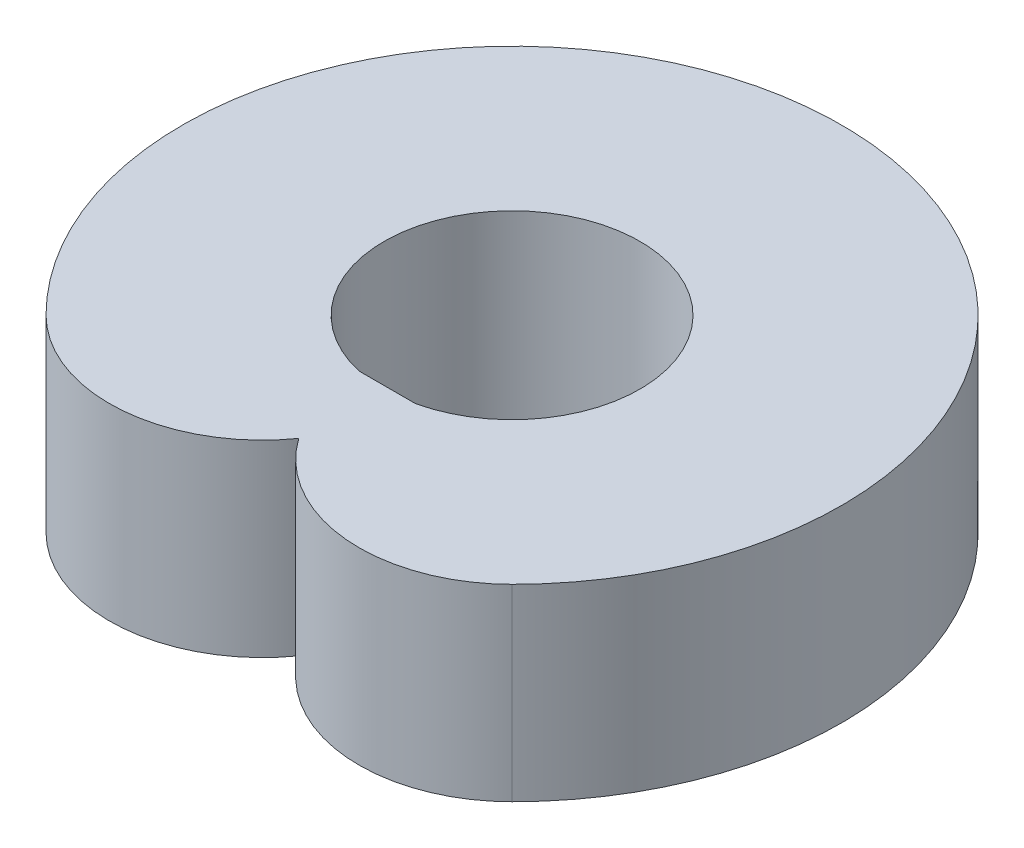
ISO-10303-21;
HEADER;
FILE_DESCRIPTION(('STEP AP214'),'2;1');
FILE_NAME('part.step','',(''),(''),'','','');
FILE_SCHEMA(('AUTOMOTIVE_DESIGN { 1 0 10303 214 1 1 1 1 }'));
ENDSEC;
DATA;
#1=APPLICATION_CONTEXT('core data for automotive mechanical design processes');
#2=APPLICATION_PROTOCOL_DEFINITION('international standard','automotive_design',2000,#1);
#3=PRODUCT_CONTEXT('',#1,'mechanical');
#4=PRODUCT('Part','Part','',(#3));
#5=PRODUCT_RELATED_PRODUCT_CATEGORY('part','',(#4));
#6=PRODUCT_DEFINITION_FORMATION('','',#4);
#7=PRODUCT_DEFINITION_CONTEXT('part definition',#1,'design');
#8=PRODUCT_DEFINITION('design','',#6,#7);
#9=PRODUCT_DEFINITION_SHAPE('','',#8);
#10=(LENGTH_UNIT() NAMED_UNIT(*) SI_UNIT(.MILLI.,.METRE.));
#11=(NAMED_UNIT(*) PLANE_ANGLE_UNIT() SI_UNIT($,.RADIAN.));
#12=(NAMED_UNIT(*) SI_UNIT($,.STERADIAN.) SOLID_ANGLE_UNIT());
#13=UNCERTAINTY_MEASURE_WITH_UNIT(LENGTH_MEASURE(1.E-05),#10,'distance_accuracy_value','');
#14=(GEOMETRIC_REPRESENTATION_CONTEXT(3) GLOBAL_UNCERTAINTY_ASSIGNED_CONTEXT((#13)) GLOBAL_UNIT_ASSIGNED_CONTEXT((#10,
#11,#12)) REPRESENTATION_CONTEXT('',''));
#15=CARTESIAN_POINT('',(0.,0.,0.));
#16=DIRECTION('',(0.,0.,1.));
#17=DIRECTION('',(1.,0.,0.));
#18=AXIS2_PLACEMENT_3D('',#15,#16,#17);
#19=CARTESIAN_POINT('',(132.582521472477,400.,132.582521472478));
#20=DIRECTION('',(0.,1.,0.));
#21=DIRECTION('',(0.,0.,1.));
#22=AXIS2_PLACEMENT_3D('',#19,#20,#21);
#23=PLANE('',#22);
#24=CARTESIAN_POINT('',(265.165042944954,400.,265.165042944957));
#25=DIRECTION('',(0.,1.,0.));
#26=DIRECTION('',(0.,0.,1.));
#27=AXIS2_PLACEMENT_3D('',#24,#25,#26);
#28=CIRCLE('',#27,325.);
#29=CARTESIAN_POINT('',(1.11022302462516E-13,400.,453.08124767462));
#30=VERTEX_POINT('',#29);
#31=CARTESIAN_POINT('',(494.974746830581,400.,494.974746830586));
#32=VERTEX_POINT('',#31);
#33=EDGE_CURVE('E97',#30,#32,#28,.T.);
#34=ORIENTED_EDGE('',*,*,#33,.T.);
#35=CARTESIAN_POINT('',(0.,400.,0.));
#36=DIRECTION('',(0.,1.,0.));
#37=DIRECTION('',(0.,0.,1.));
#38=AXIS2_PLACEMENT_3D('',#35,#36,#37);
#39=CIRCLE('',#38,700.);
#40=CARTESIAN_POINT('',(-494.97474683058,400.,494.974746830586));
#41=VERTEX_POINT('',#40);
#42=EDGE_CURVE('E100',#32,#41,#39,.T.);
#43=ORIENTED_EDGE('',*,*,#42,.T.);
#44=CARTESIAN_POINT('',(-265.165042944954,400.,265.165042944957));
#45=DIRECTION('',(0.,1.,0.));
#46=DIRECTION('',(0.,0.,1.));
#47=AXIS2_PLACEMENT_3D('',#44,#45,#46);
#48=CIRCLE('',#47,325.);
#49=EDGE_CURVE('E103',#41,#30,#48,.T.);
#50=ORIENTED_EDGE('',*,*,#49,.T.);
#51=EDGE_LOOP('',(#34,#43,#50));
#52=FACE_BOUND('',#51,.T.);
#53=DIRECTION('',(1.,0.,0.));
#54=VECTOR('',#53,1.);
#55=CARTESIAN_POINT('',(59.8349570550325,400.,265.165042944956));
#56=LINE('',#55,#54);
#57=CARTESIAN_POINT('',(-59.8349570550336,400.,265.165042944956));
#58=VERTEX_POINT('',#57);
#59=CARTESIAN_POINT('',(59.8349570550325,400.,265.165042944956));
#60=VERTEX_POINT('',#59);
#61=EDGE_CURVE('E80',#58,#60,#56,.T.);
#62=ORIENTED_EDGE('',*,*,#61,.F.);
#63=CARTESIAN_POINT('',(0.,400.,0.));
#64=DIRECTION('',(0.,1.,0.));
#65=DIRECTION('',(0.,0.,1.));
#66=AXIS2_PLACEMENT_3D('',#63,#64,#65);
#67=CIRCLE('',#66,271.832157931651);
#68=EDGE_CURVE('E86',#60,#58,#67,.T.);
#69=ORIENTED_EDGE('',*,*,#68,.F.);
#70=EDGE_LOOP('',(#62,#69));
#71=FACE_BOUND('',#70,.T.);
#72=ADVANCED_FACE('F34',(#52,#71),#23,.T.);
#73=CARTESIAN_POINT('',(132.582521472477,0.,132.582521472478));
#74=DIRECTION('',(0.,1.,0.));
#75=DIRECTION('',(0.,0.,1.));
#76=AXIS2_PLACEMENT_3D('',#73,#74,#75);
#77=PLANE('',#76);
#78=CARTESIAN_POINT('',(265.165042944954,0.,265.165042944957));
#79=DIRECTION('',(0.,1.,0.));
#80=DIRECTION('',(0.,0.,1.));
#81=AXIS2_PLACEMENT_3D('',#78,#79,#80);
#82=CIRCLE('',#81,325.);
#83=CARTESIAN_POINT('',(1.11022302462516E-13,0.,453.08124767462));
#84=VERTEX_POINT('',#83);
#85=CARTESIAN_POINT('',(494.974746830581,0.,494.974746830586));
#86=VERTEX_POINT('',#85);
#87=EDGE_CURVE('E96',#84,#86,#82,.T.);
#88=ORIENTED_EDGE('',*,*,#87,.F.);
#89=CARTESIAN_POINT('',(-265.165042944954,0.,265.165042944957));
#90=DIRECTION('',(0.,1.,0.));
#91=DIRECTION('',(0.,0.,1.));
#92=AXIS2_PLACEMENT_3D('',#89,#90,#91);
#93=CIRCLE('',#92,325.);
#94=CARTESIAN_POINT('',(-494.97474683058,0.,494.974746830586));
#95=VERTEX_POINT('',#94);
#96=EDGE_CURVE('E101',#95,#84,#93,.T.);
#97=ORIENTED_EDGE('',*,*,#96,.F.);
#98=CARTESIAN_POINT('',(0.,0.,0.));
#99=DIRECTION('',(0.,1.,0.));
#100=DIRECTION('',(0.,0.,1.));
#101=AXIS2_PLACEMENT_3D('',#98,#99,#100);
#102=CIRCLE('',#101,700.);
#103=EDGE_CURVE('E108',#86,#95,#102,.T.);
#104=ORIENTED_EDGE('',*,*,#103,.F.);
#105=EDGE_LOOP('',(#88,#97,#104));
#106=FACE_BOUND('',#105,.T.);
#107=CARTESIAN_POINT('',(0.,0.,0.));
#108=DIRECTION('',(0.,1.,0.));
#109=DIRECTION('',(0.,0.,1.));
#110=AXIS2_PLACEMENT_3D('',#107,#108,#109);
#111=CIRCLE('',#110,271.832157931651);
#112=CARTESIAN_POINT('',(59.8349570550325,0.,265.165042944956));
#113=VERTEX_POINT('',#112);
#114=CARTESIAN_POINT('',(-59.8349570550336,0.,265.165042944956));
#115=VERTEX_POINT('',#114);
#116=EDGE_CURVE('E56',#113,#115,#111,.T.);
#117=ORIENTED_EDGE('',*,*,#116,.T.);
#118=DIRECTION('',(1.,0.,0.));
#119=VECTOR('',#118,1.);
#120=CARTESIAN_POINT('',(59.8349570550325,0.,265.165042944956));
#121=LINE('',#120,#119);
#122=EDGE_CURVE('E90',#115,#113,#121,.T.);
#123=ORIENTED_EDGE('',*,*,#122,.T.);
#124=EDGE_LOOP('',(#117,#123));
#125=FACE_BOUND('',#124,.T.);
#126=ADVANCED_FACE('F122',(#106,#125),#77,.F.);
#127=CARTESIAN_POINT('',(265.165042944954,400.,265.165042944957));
#128=DIRECTION('',(0.,-1.,0.));
#129=DIRECTION('',(0.,0.,-1.));
#130=AXIS2_PLACEMENT_3D('',#127,#128,#129);
#131=CYLINDRICAL_SURFACE('',#130,325.);
#132=ORIENTED_EDGE('',*,*,#87,.T.);
#133=DIRECTION('',(0.,-1.,0.));
#134=VECTOR('',#133,1.);
#135=CARTESIAN_POINT('',(494.974746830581,400.,494.974746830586));
#136=LINE('',#135,#134);
#137=EDGE_CURVE('E11',#32,#86,#136,.T.);
#138=ORIENTED_EDGE('',*,*,#137,.F.);
#139=ORIENTED_EDGE('',*,*,#33,.F.);
#140=DIRECTION('',(0.,-1.,0.));
#141=VECTOR('',#140,1.);
#142=CARTESIAN_POINT('',(1.11022302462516E-13,400.,453.08124767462));
#143=LINE('',#142,#141);
#144=EDGE_CURVE('E105',#30,#84,#143,.T.);
#145=ORIENTED_EDGE('',*,*,#144,.T.);
#146=EDGE_LOOP('',(#132,#138,#139,#145));
#147=FACE_BOUND('',#146,.T.);
#148=ADVANCED_FACE('F36',(#147),#131,.T.);
#149=CARTESIAN_POINT('',(0.,400.,0.));
#150=DIRECTION('',(0.,-1.,0.));
#151=DIRECTION('',(0.,0.,-1.));
#152=AXIS2_PLACEMENT_3D('',#149,#150,#151);
#153=CYLINDRICAL_SURFACE('',#152,700.);
#154=ORIENTED_EDGE('',*,*,#103,.T.);
#155=DIRECTION('',(0.,-1.,0.));
#156=VECTOR('',#155,1.);
#157=CARTESIAN_POINT('',(-494.97474683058,400.,494.974746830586));
#158=LINE('',#157,#156);
#159=EDGE_CURVE('E42',#41,#95,#158,.T.);
#160=ORIENTED_EDGE('',*,*,#159,.F.);
#161=ORIENTED_EDGE('',*,*,#42,.F.);
#162=ORIENTED_EDGE('',*,*,#137,.T.);
#163=EDGE_LOOP('',(#154,#160,#161,#162));
#164=FACE_BOUND('',#163,.T.);
#165=ADVANCED_FACE('F128',(#164),#153,.T.);
#166=CARTESIAN_POINT('',(-265.165042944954,400.,265.165042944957));
#167=DIRECTION('',(0.,-1.,0.));
#168=DIRECTION('',(0.,0.,-1.));
#169=AXIS2_PLACEMENT_3D('',#166,#167,#168);
#170=CYLINDRICAL_SURFACE('',#169,325.);
#171=ORIENTED_EDGE('',*,*,#96,.T.);
#172=ORIENTED_EDGE('',*,*,#144,.F.);
#173=ORIENTED_EDGE('',*,*,#49,.F.);
#174=ORIENTED_EDGE('',*,*,#159,.T.);
#175=EDGE_LOOP('',(#171,#172,#173,#174));
#176=FACE_BOUND('',#175,.T.);
#177=ADVANCED_FACE('F117',(#176),#170,.T.);
#178=CARTESIAN_POINT('',(0.,400.,0.));
#179=DIRECTION('',(0.,-1.,0.));
#180=DIRECTION('',(0.,0.,-1.));
#181=AXIS2_PLACEMENT_3D('',#178,#179,#180);
#182=CYLINDRICAL_SURFACE('',#181,271.832157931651);
#183=ORIENTED_EDGE('',*,*,#116,.F.);
#184=DIRECTION('',(0.,-1.,0.));
#185=VECTOR('',#184,1.);
#186=CARTESIAN_POINT('',(59.8349570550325,400.,265.165042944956));
#187=LINE('',#186,#185);
#188=EDGE_CURVE('E82',#60,#113,#187,.T.);
#189=ORIENTED_EDGE('',*,*,#188,.F.);
#190=ORIENTED_EDGE('',*,*,#68,.T.);
#191=DIRECTION('',(0.,-1.,0.));
#192=VECTOR('',#191,1.);
#193=CARTESIAN_POINT('',(-59.8349570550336,400.,265.165042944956));
#194=LINE('',#193,#192);
#195=EDGE_CURVE('E49',#58,#115,#194,.T.);
#196=ORIENTED_EDGE('',*,*,#195,.T.);
#197=EDGE_LOOP('',(#183,#189,#190,#196));
#198=FACE_BOUND('',#197,.T.);
#199=ADVANCED_FACE('F88',(#198),#182,.F.);
#200=CARTESIAN_POINT('',(59.8349570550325,400.,265.165042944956));
#201=DIRECTION('',(0.,0.,-1.));
#202=DIRECTION('',(-1.,0.,0.));
#203=AXIS2_PLACEMENT_3D('',#200,#201,#202);
#204=PLANE('',#203);
#205=ORIENTED_EDGE('',*,*,#122,.F.);
#206=ORIENTED_EDGE('',*,*,#195,.F.);
#207=ORIENTED_EDGE('',*,*,#61,.T.);
#208=ORIENTED_EDGE('',*,*,#188,.T.);
#209=EDGE_LOOP('',(#205,#206,#207,#208));
#210=FACE_BOUND('',#209,.T.);
#211=ADVANCED_FACE('F81',(#210),#204,.T.);
#212=CLOSED_SHELL('',(#72,#126,#148,#165,#177,#199,#211));
#213=MANIFOLD_SOLID_BREP('B2',#212);
#214=ADVANCED_BREP_SHAPE_REPRESENTATION('',(#18,#213),#14);
#215=SHAPE_DEFINITION_REPRESENTATION(#9,#214);
ENDSEC;
END-ISO-10303-21;
